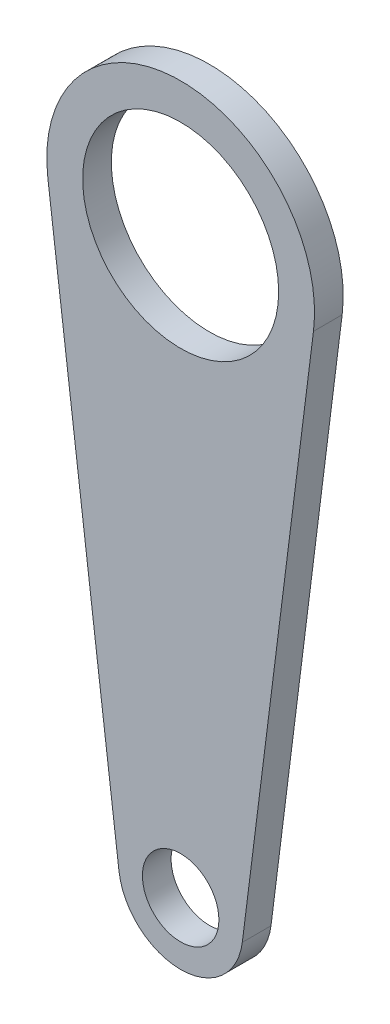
from build123d import *

# Parameters (mm, degrees)
ESQUISSE1_R          = 10.25
ESQUISSE1_R_2        = 4
BASE_EXTRUSION_DEPTH = 1.5


with BuildPart() as part:
    # Esquisse1 → Base-Extrusion (new, symmetric)
    with BuildSketch(Plane.XY):
        with BuildLine():
            Line((-13.890194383, 58.25), (-6.449018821, -0.8125))
            ThreePointArc((-6.449018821, -0.8125), (0, -6.5), (6.449018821, -0.8125))
            Line((6.449018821, -0.8125), (13.890194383, 58.25))
            ThreePointArc((13.890194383, 58.25), (0, 74), (-13.890194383, 58.25))
        make_face()
        with Locations((0, 60)):
            Circle(ESQUISSE1_R, mode=Mode.SUBTRACT)
        Circle(ESQUISSE1_R_2, mode=Mode.SUBTRACT)
    extrude(amount=BASE_EXTRUSION_DEPTH, both=True)


solid = part.part
